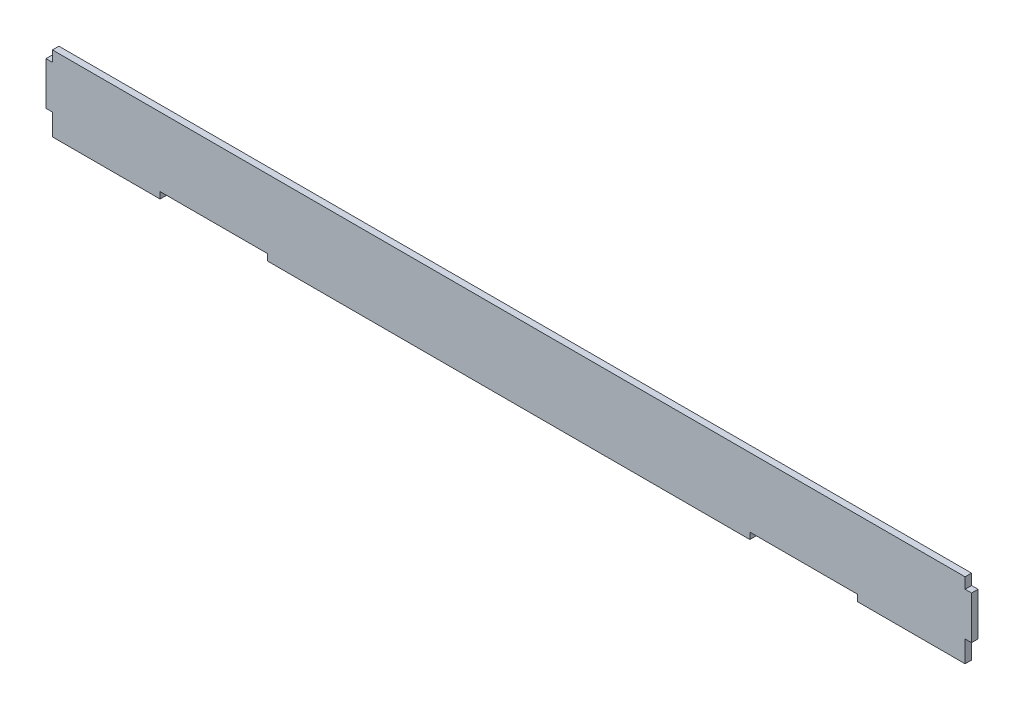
ISO-10303-21;
HEADER;
FILE_DESCRIPTION(('STEP AP214'),'2;1');
FILE_NAME('part.step','',(''),(''),'','','');
FILE_SCHEMA(('AUTOMOTIVE_DESIGN { 1 0 10303 214 1 1 1 1 }'));
ENDSEC;
DATA;
#1=APPLICATION_CONTEXT('core data for automotive mechanical design processes');
#2=APPLICATION_PROTOCOL_DEFINITION('international standard','automotive_design',2000,#1);
#3=PRODUCT_CONTEXT('',#1,'mechanical');
#4=PRODUCT('Part','Part','',(#3));
#5=PRODUCT_RELATED_PRODUCT_CATEGORY('part','',(#4));
#6=PRODUCT_DEFINITION_FORMATION('','',#4);
#7=PRODUCT_DEFINITION_CONTEXT('part definition',#1,'design');
#8=PRODUCT_DEFINITION('design','',#6,#7);
#9=PRODUCT_DEFINITION_SHAPE('','',#8);
#10=(LENGTH_UNIT() NAMED_UNIT(*) SI_UNIT(.MILLI.,.METRE.));
#11=(NAMED_UNIT(*) PLANE_ANGLE_UNIT() SI_UNIT($,.RADIAN.));
#12=(NAMED_UNIT(*) SI_UNIT($,.STERADIAN.) SOLID_ANGLE_UNIT());
#13=UNCERTAINTY_MEASURE_WITH_UNIT(LENGTH_MEASURE(1.E-05),#10,'distance_accuracy_value','');
#14=(GEOMETRIC_REPRESENTATION_CONTEXT(3) GLOBAL_UNCERTAINTY_ASSIGNED_CONTEXT((#13)) GLOBAL_UNIT_ASSIGNED_CONTEXT((#10,
#11,#12)) REPRESENTATION_CONTEXT('',''));
#15=CARTESIAN_POINT('',(0.,0.,0.));
#16=DIRECTION('',(0.,0.,1.));
#17=DIRECTION('',(1.,0.,0.));
#18=AXIS2_PLACEMENT_3D('',#15,#16,#17);
#19=CARTESIAN_POINT('',(0.,0.,3.));
#20=DIRECTION('',(1.,0.,0.));
#21=DIRECTION('',(0.,1.,0.));
#22=AXIS2_PLACEMENT_3D('',#19,#20,#21);
#23=PLANE('',#22);
#24=DIRECTION('',(0.,-1.,0.));
#25=VECTOR('',#24,1.);
#26=CARTESIAN_POINT('',(0.,0.,0.));
#27=LINE('',#26,#25);
#28=CARTESIAN_POINT('',(0.,10.,0.));
#29=VERTEX_POINT('',#28);
#30=CARTESIAN_POINT('',(0.,0.,0.));
#31=VERTEX_POINT('',#30);
#32=EDGE_CURVE('E205',#29,#31,#27,.T.);
#33=ORIENTED_EDGE('',*,*,#32,.T.);
#34=DIRECTION('',(0.,0.,-1.));
#35=VECTOR('',#34,1.);
#36=CARTESIAN_POINT('',(0.,0.,3.));
#37=LINE('',#36,#35);
#38=CARTESIAN_POINT('',(0.,0.,3.));
#39=VERTEX_POINT('',#38);
#40=EDGE_CURVE('E11',#39,#31,#37,.T.);
#41=ORIENTED_EDGE('',*,*,#40,.F.);
#42=DIRECTION('',(0.,-1.,0.));
#43=VECTOR('',#42,1.);
#44=CARTESIAN_POINT('',(0.,0.,3.));
#45=LINE('',#44,#43);
#46=CARTESIAN_POINT('',(0.,10.,3.));
#47=VERTEX_POINT('',#46);
#48=EDGE_CURVE('E243',#47,#39,#45,.T.);
#49=ORIENTED_EDGE('',*,*,#48,.F.);
#50=DIRECTION('',(0.,0.,-1.));
#51=VECTOR('',#50,1.);
#52=CARTESIAN_POINT('',(0.,10.,3.));
#53=LINE('',#52,#51);
#54=EDGE_CURVE('E201',#47,#29,#53,.T.);
#55=ORIENTED_EDGE('',*,*,#54,.T.);
#56=EDGE_LOOP('',(#33,#41,#49,#55));
#57=FACE_BOUND('',#56,.T.);
#58=ADVANCED_FACE('F37',(#57),#23,.F.);
#59=CARTESIAN_POINT('',(0.,0.,3.));
#60=DIRECTION('',(0.,1.,0.));
#61=DIRECTION('',(0.,0.,1.));
#62=AXIS2_PLACEMENT_3D('',#59,#60,#61);
#63=PLANE('',#62);
#64=DIRECTION('',(1.,0.,0.));
#65=VECTOR('',#64,1.);
#66=CARTESIAN_POINT('',(0.,0.,0.));
#67=LINE('',#66,#65);
#68=CARTESIAN_POINT('',(50.,0.,0.));
#69=VERTEX_POINT('',#68);
#70=EDGE_CURVE('E208',#31,#69,#67,.T.);
#71=ORIENTED_EDGE('',*,*,#70,.T.);
#72=DIRECTION('',(0.,0.,-1.));
#73=VECTOR('',#72,1.);
#74=CARTESIAN_POINT('',(50.,0.,3.));
#75=LINE('',#74,#73);
#76=CARTESIAN_POINT('',(50.,0.,3.));
#77=VERTEX_POINT('',#76);
#78=EDGE_CURVE('E45',#77,#69,#75,.T.);
#79=ORIENTED_EDGE('',*,*,#78,.F.);
#80=DIRECTION('',(1.,0.,0.));
#81=VECTOR('',#80,1.);
#82=CARTESIAN_POINT('',(0.,0.,3.));
#83=LINE('',#82,#81);
#84=EDGE_CURVE('E132',#39,#77,#83,.T.);
#85=ORIENTED_EDGE('',*,*,#84,.F.);
#86=ORIENTED_EDGE('',*,*,#40,.T.);
#87=EDGE_LOOP('',(#71,#79,#85,#86));
#88=FACE_BOUND('',#87,.T.);
#89=ADVANCED_FACE('F361',(#88),#63,.F.);
#90=CARTESIAN_POINT('',(50.,0.,3.));
#91=DIRECTION('',(-1.,0.,0.));
#92=DIRECTION('',(0.,0.,1.));
#93=AXIS2_PLACEMENT_3D('',#90,#91,#92);
#94=PLANE('',#93);
#95=DIRECTION('',(0.,1.,0.));
#96=VECTOR('',#95,1.);
#97=CARTESIAN_POINT('',(50.,0.,0.));
#98=LINE('',#97,#96);
#99=CARTESIAN_POINT('',(50.,3.,0.));
#100=VERTEX_POINT('',#99);
#101=EDGE_CURVE('E210',#69,#100,#98,.T.);
#102=ORIENTED_EDGE('',*,*,#101,.T.);
#103=DIRECTION('',(0.,0.,-1.));
#104=VECTOR('',#103,1.);
#105=CARTESIAN_POINT('',(50.,3.,3.));
#106=LINE('',#105,#104);
#107=CARTESIAN_POINT('',(50.,3.,3.));
#108=VERTEX_POINT('',#107);
#109=EDGE_CURVE('E286',#108,#100,#106,.T.);
#110=ORIENTED_EDGE('',*,*,#109,.F.);
#111=DIRECTION('',(0.,1.,0.));
#112=VECTOR('',#111,1.);
#113=CARTESIAN_POINT('',(50.,0.,3.));
#114=LINE('',#113,#112);
#115=EDGE_CURVE('E294',#77,#108,#114,.T.);
#116=ORIENTED_EDGE('',*,*,#115,.F.);
#117=ORIENTED_EDGE('',*,*,#78,.T.);
#118=EDGE_LOOP('',(#102,#110,#116,#117));
#119=FACE_BOUND('',#118,.T.);
#120=ADVANCED_FACE('F292',(#119),#94,.F.);
#121=CARTESIAN_POINT('',(50.,3.,3.));
#122=DIRECTION('',(0.,1.,0.));
#123=DIRECTION('',(0.,0.,1.));
#124=AXIS2_PLACEMENT_3D('',#121,#122,#123);
#125=PLANE('',#124);
#126=DIRECTION('',(1.,0.,0.));
#127=VECTOR('',#126,1.);
#128=CARTESIAN_POINT('',(50.,3.,0.));
#129=LINE('',#128,#127);
#130=CARTESIAN_POINT('',(100.,3.,0.));
#131=VERTEX_POINT('',#130);
#132=EDGE_CURVE('E212',#100,#131,#129,.T.);
#133=ORIENTED_EDGE('',*,*,#132,.T.);
#134=DIRECTION('',(0.,0.,-1.));
#135=VECTOR('',#134,1.);
#136=CARTESIAN_POINT('',(100.,3.,3.));
#137=LINE('',#136,#135);
#138=CARTESIAN_POINT('',(100.,3.,3.));
#139=VERTEX_POINT('',#138);
#140=EDGE_CURVE('E283',#139,#131,#137,.T.);
#141=ORIENTED_EDGE('',*,*,#140,.F.);
#142=DIRECTION('',(1.,0.,0.));
#143=VECTOR('',#142,1.);
#144=CARTESIAN_POINT('',(50.,3.,3.));
#145=LINE('',#144,#143);
#146=EDGE_CURVE('E312',#108,#139,#145,.T.);
#147=ORIENTED_EDGE('',*,*,#146,.F.);
#148=ORIENTED_EDGE('',*,*,#109,.T.);
#149=EDGE_LOOP('',(#133,#141,#147,#148));
#150=FACE_BOUND('',#149,.T.);
#151=ADVANCED_FACE('F303',(#150),#125,.F.);
#152=CARTESIAN_POINT('',(100.,0.,3.));
#153=DIRECTION('',(1.,0.,0.));
#154=DIRECTION('',(0.,0.,-1.));
#155=AXIS2_PLACEMENT_3D('',#152,#153,#154);
#156=PLANE('',#155);
#157=DIRECTION('',(0.,-1.,0.));
#158=VECTOR('',#157,1.);
#159=CARTESIAN_POINT('',(100.,0.,0.));
#160=LINE('',#159,#158);
#161=CARTESIAN_POINT('',(100.,0.,0.));
#162=VERTEX_POINT('',#161);
#163=EDGE_CURVE('E214',#131,#162,#160,.T.);
#164=ORIENTED_EDGE('',*,*,#163,.T.);
#165=DIRECTION('',(0.,0.,-1.));
#166=VECTOR('',#165,1.);
#167=CARTESIAN_POINT('',(100.,0.,3.));
#168=LINE('',#167,#166);
#169=CARTESIAN_POINT('',(100.,0.,3.));
#170=VERTEX_POINT('',#169);
#171=EDGE_CURVE('E280',#170,#162,#168,.T.);
#172=ORIENTED_EDGE('',*,*,#171,.F.);
#173=DIRECTION('',(0.,-1.,0.));
#174=VECTOR('',#173,1.);
#175=CARTESIAN_POINT('',(100.,0.,3.));
#176=LINE('',#175,#174);
#177=EDGE_CURVE('E309',#139,#170,#176,.T.);
#178=ORIENTED_EDGE('',*,*,#177,.F.);
#179=ORIENTED_EDGE('',*,*,#140,.T.);
#180=EDGE_LOOP('',(#164,#172,#178,#179));
#181=FACE_BOUND('',#180,.T.);
#182=ADVANCED_FACE('F307',(#181),#156,.F.);
#183=CARTESIAN_POINT('',(100.,0.,3.));
#184=DIRECTION('',(0.,1.,0.));
#185=DIRECTION('',(0.,0.,1.));
#186=AXIS2_PLACEMENT_3D('',#183,#184,#185);
#187=PLANE('',#186);
#188=DIRECTION('',(1.,0.,0.));
#189=VECTOR('',#188,1.);
#190=CARTESIAN_POINT('',(100.,0.,0.));
#191=LINE('',#190,#189);
#192=CARTESIAN_POINT('',(324.,0.,0.));
#193=VERTEX_POINT('',#192);
#194=EDGE_CURVE('E216',#162,#193,#191,.T.);
#195=ORIENTED_EDGE('',*,*,#194,.T.);
#196=DIRECTION('',(0.,0.,-1.));
#197=VECTOR('',#196,1.);
#198=CARTESIAN_POINT('',(324.,0.,3.));
#199=LINE('',#198,#197);
#200=CARTESIAN_POINT('',(324.,0.,3.));
#201=VERTEX_POINT('',#200);
#202=EDGE_CURVE('E277',#201,#193,#199,.T.);
#203=ORIENTED_EDGE('',*,*,#202,.F.);
#204=DIRECTION('',(1.,0.,0.));
#205=VECTOR('',#204,1.);
#206=CARTESIAN_POINT('',(100.,0.,3.));
#207=LINE('',#206,#205);
#208=EDGE_CURVE('E311',#170,#201,#207,.T.);
#209=ORIENTED_EDGE('',*,*,#208,.F.);
#210=ORIENTED_EDGE('',*,*,#171,.T.);
#211=EDGE_LOOP('',(#195,#203,#209,#210));
#212=FACE_BOUND('',#211,.T.);
#213=ADVANCED_FACE('F374',(#212),#187,.F.);
#214=CARTESIAN_POINT('',(324.,0.,3.));
#215=DIRECTION('',(-1.,0.,0.));
#216=DIRECTION('',(0.,0.,1.));
#217=AXIS2_PLACEMENT_3D('',#214,#215,#216);
#218=PLANE('',#217);
#219=DIRECTION('',(0.,1.,0.));
#220=VECTOR('',#219,1.);
#221=CARTESIAN_POINT('',(324.,0.,0.));
#222=LINE('',#221,#220);
#223=CARTESIAN_POINT('',(324.,3.,0.));
#224=VERTEX_POINT('',#223);
#225=EDGE_CURVE('E218',#193,#224,#222,.T.);
#226=ORIENTED_EDGE('',*,*,#225,.T.);
#227=DIRECTION('',(0.,0.,-1.));
#228=VECTOR('',#227,1.);
#229=CARTESIAN_POINT('',(324.,3.,3.));
#230=LINE('',#229,#228);
#231=CARTESIAN_POINT('',(324.,3.,3.));
#232=VERTEX_POINT('',#231);
#233=EDGE_CURVE('E274',#232,#224,#230,.T.);
#234=ORIENTED_EDGE('',*,*,#233,.F.);
#235=DIRECTION('',(0.,1.,0.));
#236=VECTOR('',#235,1.);
#237=CARTESIAN_POINT('',(324.,0.,3.));
#238=LINE('',#237,#236);
#239=EDGE_CURVE('E314',#201,#232,#238,.T.);
#240=ORIENTED_EDGE('',*,*,#239,.F.);
#241=ORIENTED_EDGE('',*,*,#202,.T.);
#242=EDGE_LOOP('',(#226,#234,#240,#241));
#243=FACE_BOUND('',#242,.T.);
#244=ADVANCED_FACE('F377',(#243),#218,.F.);
#245=CARTESIAN_POINT('',(324.,3.,3.));
#246=DIRECTION('',(0.,1.,0.));
#247=DIRECTION('',(0.,0.,1.));
#248=AXIS2_PLACEMENT_3D('',#245,#246,#247);
#249=PLANE('',#248);
#250=DIRECTION('',(1.,0.,0.));
#251=VECTOR('',#250,1.);
#252=CARTESIAN_POINT('',(324.,3.,0.));
#253=LINE('',#252,#251);
#254=CARTESIAN_POINT('',(374.,3.,0.));
#255=VERTEX_POINT('',#254);
#256=EDGE_CURVE('E220',#224,#255,#253,.T.);
#257=ORIENTED_EDGE('',*,*,#256,.T.);
#258=DIRECTION('',(0.,0.,-1.));
#259=VECTOR('',#258,1.);
#260=CARTESIAN_POINT('',(374.,3.,3.));
#261=LINE('',#260,#259);
#262=CARTESIAN_POINT('',(374.,3.,3.));
#263=VERTEX_POINT('',#262);
#264=EDGE_CURVE('E271',#263,#255,#261,.T.);
#265=ORIENTED_EDGE('',*,*,#264,.F.);
#266=DIRECTION('',(1.,0.,0.));
#267=VECTOR('',#266,1.);
#268=CARTESIAN_POINT('',(324.,3.,3.));
#269=LINE('',#268,#267);
#270=EDGE_CURVE('E320',#232,#263,#269,.T.);
#271=ORIENTED_EDGE('',*,*,#270,.F.);
#272=ORIENTED_EDGE('',*,*,#233,.T.);
#273=EDGE_LOOP('',(#257,#265,#271,#272));
#274=FACE_BOUND('',#273,.T.);
#275=ADVANCED_FACE('F381',(#274),#249,.F.);
#276=CARTESIAN_POINT('',(374.,0.,3.));
#277=DIRECTION('',(1.,0.,0.));
#278=DIRECTION('',(0.,0.,-1.));
#279=AXIS2_PLACEMENT_3D('',#276,#277,#278);
#280=PLANE('',#279);
#281=DIRECTION('',(0.,-1.,0.));
#282=VECTOR('',#281,1.);
#283=CARTESIAN_POINT('',(374.,0.,0.));
#284=LINE('',#283,#282);
#285=CARTESIAN_POINT('',(374.,0.,0.));
#286=VERTEX_POINT('',#285);
#287=EDGE_CURVE('E222',#255,#286,#284,.T.);
#288=ORIENTED_EDGE('',*,*,#287,.T.);
#289=DIRECTION('',(0.,0.,-1.));
#290=VECTOR('',#289,1.);
#291=CARTESIAN_POINT('',(374.,0.,3.));
#292=LINE('',#291,#290);
#293=CARTESIAN_POINT('',(374.,0.,3.));
#294=VERTEX_POINT('',#293);
#295=EDGE_CURVE('E268',#294,#286,#292,.T.);
#296=ORIENTED_EDGE('',*,*,#295,.F.);
#297=DIRECTION('',(0.,-1.,0.));
#298=VECTOR('',#297,1.);
#299=CARTESIAN_POINT('',(374.,0.,3.));
#300=LINE('',#299,#298);
#301=EDGE_CURVE('E322',#263,#294,#300,.T.);
#302=ORIENTED_EDGE('',*,*,#301,.F.);
#303=ORIENTED_EDGE('',*,*,#264,.T.);
#304=EDGE_LOOP('',(#288,#296,#302,#303));
#305=FACE_BOUND('',#304,.T.);
#306=ADVANCED_FACE('F385',(#305),#280,.F.);
#307=CARTESIAN_POINT('',(374.,0.,3.));
#308=DIRECTION('',(0.,1.,0.));
#309=DIRECTION('',(0.,0.,1.));
#310=AXIS2_PLACEMENT_3D('',#307,#308,#309);
#311=PLANE('',#310);
#312=DIRECTION('',(1.,0.,0.));
#313=VECTOR('',#312,1.);
#314=CARTESIAN_POINT('',(374.,0.,0.));
#315=LINE('',#314,#313);
#316=CARTESIAN_POINT('',(424.,0.,0.));
#317=VERTEX_POINT('',#316);
#318=EDGE_CURVE('E224',#286,#317,#315,.T.);
#319=ORIENTED_EDGE('',*,*,#318,.T.);
#320=DIRECTION('',(0.,0.,-1.));
#321=VECTOR('',#320,1.);
#322=CARTESIAN_POINT('',(424.,0.,3.));
#323=LINE('',#322,#321);
#324=CARTESIAN_POINT('',(424.,0.,3.));
#325=VERTEX_POINT('',#324);
#326=EDGE_CURVE('E265',#325,#317,#323,.T.);
#327=ORIENTED_EDGE('',*,*,#326,.F.);
#328=DIRECTION('',(1.,0.,0.));
#329=VECTOR('',#328,1.);
#330=CARTESIAN_POINT('',(374.,0.,3.));
#331=LINE('',#330,#329);
#332=EDGE_CURVE('E324',#294,#325,#331,.T.);
#333=ORIENTED_EDGE('',*,*,#332,.F.);
#334=ORIENTED_EDGE('',*,*,#295,.T.);
#335=EDGE_LOOP('',(#319,#327,#333,#334));
#336=FACE_BOUND('',#335,.T.);
#337=ADVANCED_FACE('F389',(#336),#311,.F.);
#338=CARTESIAN_POINT('',(424.,0.,3.));
#339=DIRECTION('',(-1.,0.,0.));
#340=DIRECTION('',(0.,0.,1.));
#341=AXIS2_PLACEMENT_3D('',#338,#339,#340);
#342=PLANE('',#341);
#343=DIRECTION('',(0.,1.,0.));
#344=VECTOR('',#343,1.);
#345=CARTESIAN_POINT('',(424.,0.,0.));
#346=LINE('',#345,#344);
#347=CARTESIAN_POINT('',(424.,10.,0.));
#348=VERTEX_POINT('',#347);
#349=EDGE_CURVE('E226',#317,#348,#346,.T.);
#350=ORIENTED_EDGE('',*,*,#349,.T.);
#351=DIRECTION('',(0.,0.,-1.));
#352=VECTOR('',#351,1.);
#353=CARTESIAN_POINT('',(424.,10.,3.));
#354=LINE('',#353,#352);
#355=CARTESIAN_POINT('',(424.,10.,3.));
#356=VERTEX_POINT('',#355);
#357=EDGE_CURVE('E262',#356,#348,#354,.T.);
#358=ORIENTED_EDGE('',*,*,#357,.F.);
#359=DIRECTION('',(0.,1.,0.));
#360=VECTOR('',#359,1.);
#361=CARTESIAN_POINT('',(424.,0.,3.));
#362=LINE('',#361,#360);
#363=EDGE_CURVE('E326',#325,#356,#362,.T.);
#364=ORIENTED_EDGE('',*,*,#363,.F.);
#365=ORIENTED_EDGE('',*,*,#326,.T.);
#366=EDGE_LOOP('',(#350,#358,#364,#365));
#367=FACE_BOUND('',#366,.T.);
#368=ADVANCED_FACE('F393',(#367),#342,.F.);
#369=CARTESIAN_POINT('',(424.,10.,3.));
#370=DIRECTION('',(0.,1.,0.));
#371=DIRECTION('',(0.,0.,1.));
#372=AXIS2_PLACEMENT_3D('',#369,#370,#371);
#373=PLANE('',#372);
#374=DIRECTION('',(1.,0.,0.));
#375=VECTOR('',#374,1.);
#376=CARTESIAN_POINT('',(424.,10.,0.));
#377=LINE('',#376,#375);
#378=CARTESIAN_POINT('',(427.,10.,0.));
#379=VERTEX_POINT('',#378);
#380=EDGE_CURVE('E228',#348,#379,#377,.T.);
#381=ORIENTED_EDGE('',*,*,#380,.T.);
#382=DIRECTION('',(0.,0.,-1.));
#383=VECTOR('',#382,1.);
#384=CARTESIAN_POINT('',(427.,10.,3.));
#385=LINE('',#384,#383);
#386=CARTESIAN_POINT('',(427.,10.,3.));
#387=VERTEX_POINT('',#386);
#388=EDGE_CURVE('E259',#387,#379,#385,.T.);
#389=ORIENTED_EDGE('',*,*,#388,.F.);
#390=DIRECTION('',(1.,0.,0.));
#391=VECTOR('',#390,1.);
#392=CARTESIAN_POINT('',(424.,10.,3.));
#393=LINE('',#392,#391);
#394=EDGE_CURVE('E328',#356,#387,#393,.T.);
#395=ORIENTED_EDGE('',*,*,#394,.F.);
#396=ORIENTED_EDGE('',*,*,#357,.T.);
#397=EDGE_LOOP('',(#381,#389,#395,#396));
#398=FACE_BOUND('',#397,.T.);
#399=ADVANCED_FACE('F397',(#398),#373,.F.);
#400=CARTESIAN_POINT('',(427.,30.,3.));
#401=DIRECTION('',(-1.,0.,0.));
#402=DIRECTION('',(0.,0.,1.));
#403=AXIS2_PLACEMENT_3D('',#400,#401,#402);
#404=PLANE('',#403);
#405=DIRECTION('',(0.,1.,0.));
#406=VECTOR('',#405,1.);
#407=CARTESIAN_POINT('',(427.,30.,0.));
#408=LINE('',#407,#406);
#409=CARTESIAN_POINT('',(427.,30.,0.));
#410=VERTEX_POINT('',#409);
#411=EDGE_CURVE('E230',#379,#410,#408,.T.);
#412=ORIENTED_EDGE('',*,*,#411,.T.);
#413=DIRECTION('',(0.,0.,-1.));
#414=VECTOR('',#413,1.);
#415=CARTESIAN_POINT('',(427.,30.,3.));
#416=LINE('',#415,#414);
#417=CARTESIAN_POINT('',(427.,30.,3.));
#418=VERTEX_POINT('',#417);
#419=EDGE_CURVE('E256',#418,#410,#416,.T.);
#420=ORIENTED_EDGE('',*,*,#419,.F.);
#421=DIRECTION('',(0.,1.,0.));
#422=VECTOR('',#421,1.);
#423=CARTESIAN_POINT('',(427.,30.,3.));
#424=LINE('',#423,#422);
#425=EDGE_CURVE('E330',#387,#418,#424,.T.);
#426=ORIENTED_EDGE('',*,*,#425,.F.);
#427=ORIENTED_EDGE('',*,*,#388,.T.);
#428=EDGE_LOOP('',(#412,#420,#426,#427));
#429=FACE_BOUND('',#428,.T.);
#430=ADVANCED_FACE('F401',(#429),#404,.F.);
#431=CARTESIAN_POINT('',(424.,30.,3.));
#432=DIRECTION('',(0.,-1.,0.));
#433=DIRECTION('',(0.,0.,-1.));
#434=AXIS2_PLACEMENT_3D('',#431,#432,#433);
#435=PLANE('',#434);
#436=DIRECTION('',(-1.,0.,0.));
#437=VECTOR('',#436,1.);
#438=CARTESIAN_POINT('',(424.,30.,0.));
#439=LINE('',#438,#437);
#440=CARTESIAN_POINT('',(424.,30.,0.));
#441=VERTEX_POINT('',#440);
#442=EDGE_CURVE('E232',#410,#441,#439,.T.);
#443=ORIENTED_EDGE('',*,*,#442,.T.);
#444=DIRECTION('',(0.,0.,-1.));
#445=VECTOR('',#444,1.);
#446=CARTESIAN_POINT('',(424.,30.,3.));
#447=LINE('',#446,#445);
#448=CARTESIAN_POINT('',(424.,30.,3.));
#449=VERTEX_POINT('',#448);
#450=EDGE_CURVE('E253',#449,#441,#447,.T.);
#451=ORIENTED_EDGE('',*,*,#450,.F.);
#452=DIRECTION('',(-1.,0.,0.));
#453=VECTOR('',#452,1.);
#454=CARTESIAN_POINT('',(424.,30.,3.));
#455=LINE('',#454,#453);
#456=EDGE_CURVE('E332',#418,#449,#455,.T.);
#457=ORIENTED_EDGE('',*,*,#456,.F.);
#458=ORIENTED_EDGE('',*,*,#419,.T.);
#459=EDGE_LOOP('',(#443,#451,#457,#458));
#460=FACE_BOUND('',#459,.T.);
#461=ADVANCED_FACE('F405',(#460),#435,.F.);
#462=CARTESIAN_POINT('',(424.,30.,3.));
#463=DIRECTION('',(-1.,0.,0.));
#464=DIRECTION('',(0.,0.,1.));
#465=AXIS2_PLACEMENT_3D('',#462,#463,#464);
#466=PLANE('',#465);
#467=DIRECTION('',(0.,1.,0.));
#468=VECTOR('',#467,1.);
#469=CARTESIAN_POINT('',(424.,30.,0.));
#470=LINE('',#469,#468);
#471=CARTESIAN_POINT('',(424.,35.,0.));
#472=VERTEX_POINT('',#471);
#473=EDGE_CURVE('E234',#441,#472,#470,.T.);
#474=ORIENTED_EDGE('',*,*,#473,.T.);
#475=DIRECTION('',(0.,0.,-1.));
#476=VECTOR('',#475,1.);
#477=CARTESIAN_POINT('',(424.,35.,3.));
#478=LINE('',#477,#476);
#479=CARTESIAN_POINT('',(424.,35.,3.));
#480=VERTEX_POINT('',#479);
#481=EDGE_CURVE('E250',#480,#472,#478,.T.);
#482=ORIENTED_EDGE('',*,*,#481,.F.);
#483=DIRECTION('',(0.,1.,0.));
#484=VECTOR('',#483,1.);
#485=CARTESIAN_POINT('',(424.,30.,3.));
#486=LINE('',#485,#484);
#487=EDGE_CURVE('E334',#449,#480,#486,.T.);
#488=ORIENTED_EDGE('',*,*,#487,.F.);
#489=ORIENTED_EDGE('',*,*,#450,.T.);
#490=EDGE_LOOP('',(#474,#482,#488,#489));
#491=FACE_BOUND('',#490,.T.);
#492=ADVANCED_FACE('F409',(#491),#466,.F.);
#493=CARTESIAN_POINT('',(0.,35.,3.));
#494=DIRECTION('',(0.,-1.,0.));
#495=DIRECTION('',(0.,0.,-1.));
#496=AXIS2_PLACEMENT_3D('',#493,#494,#495);
#497=PLANE('',#496);
#498=DIRECTION('',(-1.,0.,0.));
#499=VECTOR('',#498,1.);
#500=CARTESIAN_POINT('',(0.,35.,0.));
#501=LINE('',#500,#499);
#502=CARTESIAN_POINT('',(0.,35.,0.));
#503=VERTEX_POINT('',#502);
#504=EDGE_CURVE('E236',#472,#503,#501,.T.);
#505=ORIENTED_EDGE('',*,*,#504,.T.);
#506=DIRECTION('',(0.,0.,-1.));
#507=VECTOR('',#506,1.);
#508=CARTESIAN_POINT('',(0.,35.,3.));
#509=LINE('',#508,#507);
#510=CARTESIAN_POINT('',(0.,35.,3.));
#511=VERTEX_POINT('',#510);
#512=EDGE_CURVE('E247',#511,#503,#509,.T.);
#513=ORIENTED_EDGE('',*,*,#512,.F.);
#514=DIRECTION('',(-1.,0.,0.));
#515=VECTOR('',#514,1.);
#516=CARTESIAN_POINT('',(0.,35.,3.));
#517=LINE('',#516,#515);
#518=EDGE_CURVE('E336',#480,#511,#517,.T.);
#519=ORIENTED_EDGE('',*,*,#518,.F.);
#520=ORIENTED_EDGE('',*,*,#481,.T.);
#521=EDGE_LOOP('',(#505,#513,#519,#520));
#522=FACE_BOUND('',#521,.T.);
#523=ADVANCED_FACE('F342',(#522),#497,.F.);
#524=CARTESIAN_POINT('',(0.,30.,3.));
#525=DIRECTION('',(1.,0.,0.));
#526=DIRECTION('',(0.,1.,0.));
#527=AXIS2_PLACEMENT_3D('',#524,#525,#526);
#528=PLANE('',#527);
#529=DIRECTION('',(0.,-1.,0.));
#530=VECTOR('',#529,1.);
#531=CARTESIAN_POINT('',(0.,30.,0.));
#532=LINE('',#531,#530);
#533=CARTESIAN_POINT('',(0.,30.,0.));
#534=VERTEX_POINT('',#533);
#535=EDGE_CURVE('E238',#503,#534,#532,.T.);
#536=ORIENTED_EDGE('',*,*,#535,.T.);
#537=DIRECTION('',(0.,0.,-1.));
#538=VECTOR('',#537,1.);
#539=CARTESIAN_POINT('',(0.,30.,3.));
#540=LINE('',#539,#538);
#541=CARTESIAN_POINT('',(0.,30.,3.));
#542=VERTEX_POINT('',#541);
#543=EDGE_CURVE('E196',#542,#534,#540,.T.);
#544=ORIENTED_EDGE('',*,*,#543,.F.);
#545=DIRECTION('',(0.,-1.,0.));
#546=VECTOR('',#545,1.);
#547=CARTESIAN_POINT('',(0.,30.,3.));
#548=LINE('',#547,#546);
#549=EDGE_CURVE('E187',#511,#542,#548,.T.);
#550=ORIENTED_EDGE('',*,*,#549,.F.);
#551=ORIENTED_EDGE('',*,*,#512,.T.);
#552=EDGE_LOOP('',(#536,#544,#550,#551));
#553=FACE_BOUND('',#552,.T.);
#554=ADVANCED_FACE('F346',(#553),#528,.F.);
#555=CARTESIAN_POINT('',(0.,30.,3.));
#556=DIRECTION('',(0.,-1.,0.));
#557=DIRECTION('',(0.,0.,-1.));
#558=AXIS2_PLACEMENT_3D('',#555,#556,#557);
#559=PLANE('',#558);
#560=DIRECTION('',(-1.,0.,0.));
#561=VECTOR('',#560,1.);
#562=CARTESIAN_POINT('',(0.,30.,0.));
#563=LINE('',#562,#561);
#564=CARTESIAN_POINT('',(-3.,30.,0.));
#565=VERTEX_POINT('',#564);
#566=EDGE_CURVE('E195',#534,#565,#563,.T.);
#567=ORIENTED_EDGE('',*,*,#566,.T.);
#568=DIRECTION('',(0.,0.,-1.));
#569=VECTOR('',#568,1.);
#570=CARTESIAN_POINT('',(-3.,30.,3.));
#571=LINE('',#570,#569);
#572=CARTESIAN_POINT('',(-3.,30.,3.));
#573=VERTEX_POINT('',#572);
#574=EDGE_CURVE('E192',#573,#565,#571,.T.);
#575=ORIENTED_EDGE('',*,*,#574,.F.);
#576=DIRECTION('',(-1.,0.,0.));
#577=VECTOR('',#576,1.);
#578=CARTESIAN_POINT('',(0.,30.,3.));
#579=LINE('',#578,#577);
#580=EDGE_CURVE('E181',#542,#573,#579,.T.);
#581=ORIENTED_EDGE('',*,*,#580,.F.);
#582=ORIENTED_EDGE('',*,*,#543,.T.);
#583=EDGE_LOOP('',(#567,#575,#581,#582));
#584=FACE_BOUND('',#583,.T.);
#585=ADVANCED_FACE('F193',(#584),#559,.F.);
#586=CARTESIAN_POINT('',(-3.,30.,3.));
#587=DIRECTION('',(1.,0.,0.));
#588=DIRECTION('',(0.,1.,0.));
#589=AXIS2_PLACEMENT_3D('',#586,#587,#588);
#590=PLANE('',#589);
#591=DIRECTION('',(0.,-1.,0.));
#592=VECTOR('',#591,1.);
#593=CARTESIAN_POINT('',(-3.,30.,0.));
#594=LINE('',#593,#592);
#595=CARTESIAN_POINT('',(-3.,10.,0.));
#596=VERTEX_POINT('',#595);
#597=EDGE_CURVE('E118',#565,#596,#594,.T.);
#598=ORIENTED_EDGE('',*,*,#597,.T.);
#599=DIRECTION('',(0.,0.,-1.));
#600=VECTOR('',#599,1.);
#601=CARTESIAN_POINT('',(-3.,10.,3.));
#602=LINE('',#601,#600);
#603=CARTESIAN_POINT('',(-3.,10.,3.));
#604=VERTEX_POINT('',#603);
#605=EDGE_CURVE('E197',#604,#596,#602,.T.);
#606=ORIENTED_EDGE('',*,*,#605,.F.);
#607=DIRECTION('',(0.,-1.,0.));
#608=VECTOR('',#607,1.);
#609=CARTESIAN_POINT('',(-3.,30.,3.));
#610=LINE('',#609,#608);
#611=EDGE_CURVE('E185',#573,#604,#610,.T.);
#612=ORIENTED_EDGE('',*,*,#611,.F.);
#613=ORIENTED_EDGE('',*,*,#574,.T.);
#614=EDGE_LOOP('',(#598,#606,#612,#613));
#615=FACE_BOUND('',#614,.T.);
#616=ADVANCED_FACE('F199',(#615),#590,.F.);
#617=CARTESIAN_POINT('',(0.,10.,3.));
#618=DIRECTION('',(0.,1.,0.));
#619=DIRECTION('',(-1.,0.,0.));
#620=AXIS2_PLACEMENT_3D('',#617,#618,#619);
#621=PLANE('',#620);
#622=DIRECTION('',(1.,0.,0.));
#623=VECTOR('',#622,1.);
#624=CARTESIAN_POINT('',(0.,10.,0.));
#625=LINE('',#624,#623);
#626=EDGE_CURVE('E124',#596,#29,#625,.T.);
#627=ORIENTED_EDGE('',*,*,#626,.T.);
#628=ORIENTED_EDGE('',*,*,#54,.F.);
#629=DIRECTION('',(1.,0.,0.));
#630=VECTOR('',#629,1.);
#631=CARTESIAN_POINT('',(0.,10.,3.));
#632=LINE('',#631,#630);
#633=EDGE_CURVE('E53',#604,#47,#632,.T.);
#634=ORIENTED_EDGE('',*,*,#633,.F.);
#635=ORIENTED_EDGE('',*,*,#605,.T.);
#636=EDGE_LOOP('',(#627,#628,#634,#635));
#637=FACE_BOUND('',#636,.T.);
#638=ADVANCED_FACE('F350',(#637),#621,.F.);
#639=CARTESIAN_POINT('',(0.,0.,3.));
#640=DIRECTION('',(0.,0.,1.));
#641=DIRECTION('',(1.,0.,0.));
#642=AXIS2_PLACEMENT_3D('',#639,#640,#641);
#643=PLANE('',#642);
#644=ORIENTED_EDGE('',*,*,#48,.T.);
#645=ORIENTED_EDGE('',*,*,#84,.T.);
#646=ORIENTED_EDGE('',*,*,#115,.T.);
#647=ORIENTED_EDGE('',*,*,#146,.T.);
#648=ORIENTED_EDGE('',*,*,#177,.T.);
#649=ORIENTED_EDGE('',*,*,#208,.T.);
#650=ORIENTED_EDGE('',*,*,#239,.T.);
#651=ORIENTED_EDGE('',*,*,#270,.T.);
#652=ORIENTED_EDGE('',*,*,#301,.T.);
#653=ORIENTED_EDGE('',*,*,#332,.T.);
#654=ORIENTED_EDGE('',*,*,#363,.T.);
#655=ORIENTED_EDGE('',*,*,#394,.T.);
#656=ORIENTED_EDGE('',*,*,#425,.T.);
#657=ORIENTED_EDGE('',*,*,#456,.T.);
#658=ORIENTED_EDGE('',*,*,#487,.T.);
#659=ORIENTED_EDGE('',*,*,#518,.T.);
#660=ORIENTED_EDGE('',*,*,#549,.T.);
#661=ORIENTED_EDGE('',*,*,#580,.T.);
#662=ORIENTED_EDGE('',*,*,#611,.T.);
#663=ORIENTED_EDGE('',*,*,#633,.T.);
#664=EDGE_LOOP('',(#644,#645,#646,#647,#648,#649,#650,#651,#652,#653,#654,#655,#656,#657,#658,
#659,#660,#661,#662,#663));
#665=FACE_BOUND('',#664,.T.);
#666=ADVANCED_FACE('F183',(#665),#643,.T.);
#667=CARTESIAN_POINT('',(0.,0.,0.));
#668=DIRECTION('',(0.,0.,1.));
#669=DIRECTION('',(1.,0.,0.));
#670=AXIS2_PLACEMENT_3D('',#667,#668,#669);
#671=PLANE('',#670);
#672=ORIENTED_EDGE('',*,*,#32,.F.);
#673=ORIENTED_EDGE('',*,*,#626,.F.);
#674=ORIENTED_EDGE('',*,*,#597,.F.);
#675=ORIENTED_EDGE('',*,*,#566,.F.);
#676=ORIENTED_EDGE('',*,*,#535,.F.);
#677=ORIENTED_EDGE('',*,*,#504,.F.);
#678=ORIENTED_EDGE('',*,*,#473,.F.);
#679=ORIENTED_EDGE('',*,*,#442,.F.);
#680=ORIENTED_EDGE('',*,*,#411,.F.);
#681=ORIENTED_EDGE('',*,*,#380,.F.);
#682=ORIENTED_EDGE('',*,*,#349,.F.);
#683=ORIENTED_EDGE('',*,*,#318,.F.);
#684=ORIENTED_EDGE('',*,*,#287,.F.);
#685=ORIENTED_EDGE('',*,*,#256,.F.);
#686=ORIENTED_EDGE('',*,*,#225,.F.);
#687=ORIENTED_EDGE('',*,*,#194,.F.);
#688=ORIENTED_EDGE('',*,*,#163,.F.);
#689=ORIENTED_EDGE('',*,*,#132,.F.);
#690=ORIENTED_EDGE('',*,*,#101,.F.);
#691=ORIENTED_EDGE('',*,*,#70,.F.);
#692=EDGE_LOOP('',(#672,#673,#674,#675,#676,#677,#678,#679,#680,#681,#682,#683,#684,#685,#686,
#687,#688,#689,#690,#691));
#693=FACE_BOUND('',#692,.T.);
#694=ADVANCED_FACE('F298',(#693),#671,.F.);
#695=CLOSED_SHELL('',(#58,#89,#120,#151,#182,#213,#244,#275,#306,#337,#368,#399,#430,#461,#492,
#523,#554,#585,#616,#638,#666,#694));
#696=MANIFOLD_SOLID_BREP('B2',#695);
#697=ADVANCED_BREP_SHAPE_REPRESENTATION('',(#18,#696),#14);
#698=SHAPE_DEFINITION_REPRESENTATION(#9,#697);
ENDSEC;
END-ISO-10303-21;
